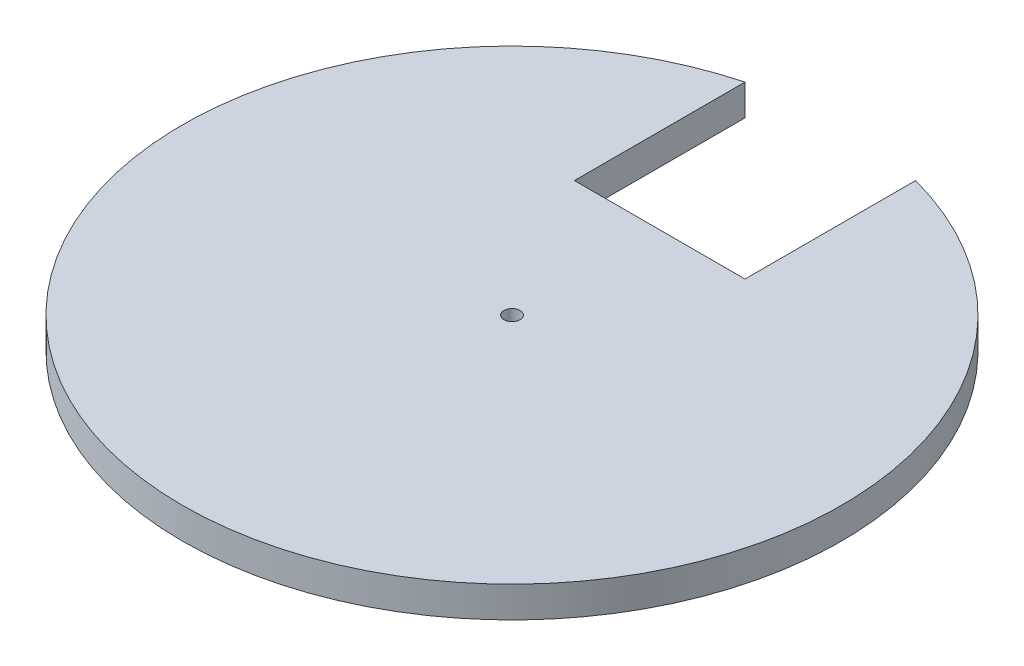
from build123d import *

# Parameters (mm, degrees)
BOSS_EXTRUDE1_DEPTH = 10
SKETCH3_R           = 2.6
CUT_EXTRUDE1_DEPTH  = 10


with BuildPart() as part:
    # Sketch2 → Boss-Extrude1 (new body)
    with BuildSketch(Plane(origin=(0, 0, 0), x_dir=(1, 0, 0), z_dir=(0, 1, 0))):
        with BuildLine():
            Line((0, 0), (55, 0))
            Line((55, 0), (55, 55))
            ThreePointArc((55, 55), (27.5, -153.8832381), (0, 55))
            Line((0, 55), (0, 0))
        make_face()
    extrude(amount=BOSS_EXTRUDE1_DEPTH)

    # Sketch3 → Cut-Extrude1 (cut)
    with BuildSketch(Plane(origin=(0, 10, 0), x_dir=(1, 0, 0), z_dir=(0, 1, 0))):
        with Locations(Location((27.5, -47.631397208, 0), (0, 0, 270))):
            Circle(SKETCH3_R)
    extrude(amount=-CUT_EXTRUDE1_DEPTH, mode=Mode.SUBTRACT)


solid = part.part
